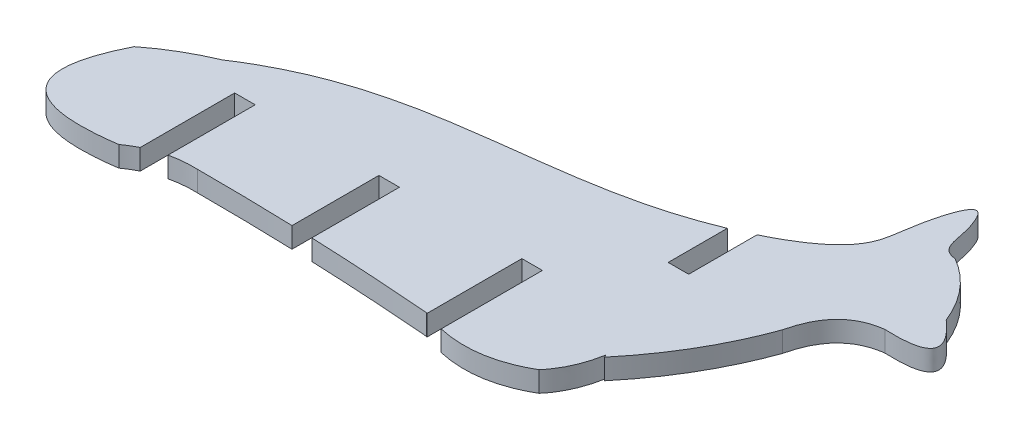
from build123d import *

# Parameters (mm, degrees)
SALIENTE_EXTRUIR1_DEPTH = 3


with BuildPart() as part:
    # Croquis2 → Saliente-Extruir1 (new body)
    with BuildSketch(Plane(origin=(0, 0, 0), x_dir=(1, 0, 0), z_dir=(0, 1, 0))):
        with BuildLine():
            Line((55.05664845, 13.565418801), (55.240587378, 13.23202084))
            add(Edge.make_bspline(
                [(55.240587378, 13.23202084), (61.580578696, 20.799919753), (64.788177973, 29.701552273)],
                knots=[0, 0, 0, 0.729810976, 0.729810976, 0.729810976], degree=2))
            add(Edge.make_bspline(
                [(64.788177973, 29.701552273), (66.345854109, 36.510249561), (72.231377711, 37.247875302)],
                knots=[0, 0, 0, 1, 1, 1], degree=2))
            add(Edge.make_bspline(
                [(72.231377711, 37.247875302), (82.473682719, 36.798598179), (75.526750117, 42.926750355)],
                knots=[0, 0, 0, 1, 1, 1], degree=2))
            add(Edge.make_bspline(
                [(75.526750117, 42.926750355), (73.292636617, 48.501107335), (68.403186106, 51.352545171)],
                knots=[0, 0, 0, 1, 1, 1], degree=2))
            add(Edge.make_bspline(
                [(68.403186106, 51.352545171), (66.12485751, 51.559944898), (66.25831179, 54.721306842), (63.600309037, 61.437225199), (61.00615012, 52.72239265), (60.877453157, 45.614236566), (54.89074914, 41.821505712), (50.893759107, 39.880415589)],
                knots=[0, 0, 0, 0, 0.056297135, 0.095033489, 0.158095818, 0.219406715, 0.344529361, 0.344529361, 0.344529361, 0.344529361], degree=3))
            Line((50.893759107, 39.880415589), (50.893759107, 29.880415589))
            Line((50.893759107, 29.880415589), (47.893759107, 29.880415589))
            Line((47.893759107, 29.880415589), (47.893759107, 38.531424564))
            add(Edge.make_bspline(
                [(47.893759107, 38.531424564), (28.008224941, 30.280642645), (8.635550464, 35.497708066), (-10.374158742, 22.936071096)],
                knots=[0.375874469, 0.375874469, 0.375874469, 0.375874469, 1, 1, 1, 1], degree=3))
            add(Edge.make_bspline(
                [(-18.516922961, 18.150768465), (-16.029368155, 20.125160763), (-13.279703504, 21.690457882), (-10.374158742, 22.936071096)],
                knots=[0.333246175, 0.333246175, 0.333246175, 0.333246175, 0.571137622, 0.571137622, 0.571137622, 0.571137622], degree=3))
            add(Edge.make_bspline(
                [(-18.516922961, 18.150768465), (-26.752270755, 1.770845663), (-7.233716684, 4.643674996)],
                knots=[0, 0, 0, 1, 1, 1], degree=2))
            add(Edge.make_bspline(
                [(-5.293400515, 5.822635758), (-5.964431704, 5.487907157), (-6.611203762, 5.094920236), (-7.233716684, 4.643674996)],
                knots=[0.757247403, 0.757247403, 0.757247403, 0.757247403, 1, 1, 1, 1], degree=3))
            Line((-5.293400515, 5.822635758), (-5.293400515, 19.643674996))
            Line((-5.293400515, 19.643674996), (-2.293400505, 19.643674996))
            Line((-2.293400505, 19.643674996), (-2.293400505, 6.894940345))
            add(Edge.make_bspline(
                [(1.694465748, 7.25441614), (-0.404856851, 7.327771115), (-2.293400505, 6.894940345)],
                knots=[0, 0, 0, 0.413122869, 0.413122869, 0.413122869], degree=2))
            add(Edge.make_bspline(
                [(15.706599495, 7.031839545), (11.038092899, 7.184301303), (6.36738165, 7.258493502), (1.694465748, 7.25441614)],
                knots=[0.702434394, 0.702434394, 0.702434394, 0.702434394, 1, 1, 1, 1], degree=3))
            Line((15.706599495, 7.031839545), (15.706599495, 19.749360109))
            Line((15.706599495, 19.749360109), (18.7065995, 19.749360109))
            Line((18.7065995, 19.749360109), (18.7065995, 6.923081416))
            add(Edge.make_bspline(
                [(36.557355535, 5.829267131), (30.610690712, 6.321224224), (24.6604387, 6.685828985), (18.7065995, 6.923081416)],
                knots=[0.259120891, 0.259120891, 0.259120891, 0.259120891, 0.638689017, 0.638689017, 0.638689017, 0.638689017], degree=3))
            add(Edge.make_bspline(
                [(36.557355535, 5.829267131), (36.632013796, 5.799620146), (36.7065995, 5.770599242)],
                knots=[0, 0, 0, 0.009141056, 0.009141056, 0.009141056], degree=2))
            Line((36.7065995, 5.770599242), (36.7065995, 19.667448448))
            Line((36.7065995, 19.667448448), (39.706599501, 19.667448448))
            Line((39.706599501, 19.667448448), (39.706599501, 4.849968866))
            add(Edge.make_bspline(
                [(39.706599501, 4.849968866), (43.999967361, 3.892541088), (48.105683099, 4.554354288), (52.023746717, 6.835408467)],
                knots=[0.194812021, 0.194812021, 0.194812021, 0.194812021, 1, 1, 1, 1], degree=3))
            add(Edge.make_bspline(
                [(55.05664845, 13.565418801), (54.337343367, 9.511159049), (52.023746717, 6.835408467)],
                knots=[0, 0, 0, 0.509778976, 0.509778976, 0.509778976], degree=2))
        make_face()
    extrude(amount=SALIENTE_EXTRUIR1_DEPTH)


solid = part.part
